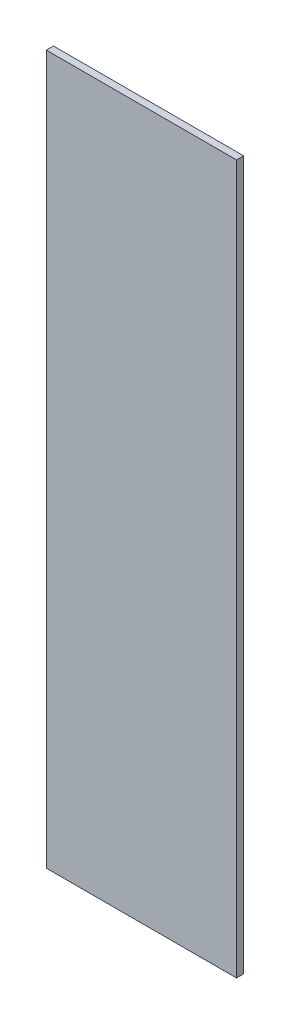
ISO-10303-21;
HEADER;
FILE_DESCRIPTION(('STEP AP214'),'2;1');
FILE_NAME('part.step','',(''),(''),'','','');
FILE_SCHEMA(('AUTOMOTIVE_DESIGN { 1 0 10303 214 1 1 1 1 }'));
ENDSEC;
DATA;
#1=APPLICATION_CONTEXT('core data for automotive mechanical design processes');
#2=APPLICATION_PROTOCOL_DEFINITION('international standard','automotive_design',2000,#1);
#3=PRODUCT_CONTEXT('',#1,'mechanical');
#4=PRODUCT('Part','Part','',(#3));
#5=PRODUCT_RELATED_PRODUCT_CATEGORY('part','',(#4));
#6=PRODUCT_DEFINITION_FORMATION('','',#4);
#7=PRODUCT_DEFINITION_CONTEXT('part definition',#1,'design');
#8=PRODUCT_DEFINITION('design','',#6,#7);
#9=PRODUCT_DEFINITION_SHAPE('','',#8);
#10=(LENGTH_UNIT() NAMED_UNIT(*) SI_UNIT(.MILLI.,.METRE.));
#11=(NAMED_UNIT(*) PLANE_ANGLE_UNIT() SI_UNIT($,.RADIAN.));
#12=(NAMED_UNIT(*) SI_UNIT($,.STERADIAN.) SOLID_ANGLE_UNIT());
#13=UNCERTAINTY_MEASURE_WITH_UNIT(LENGTH_MEASURE(1.E-05),#10,'distance_accuracy_value','');
#14=(GEOMETRIC_REPRESENTATION_CONTEXT(3) GLOBAL_UNCERTAINTY_ASSIGNED_CONTEXT((#13)) GLOBAL_UNIT_ASSIGNED_CONTEXT((#10,
#11,#12)) REPRESENTATION_CONTEXT('',''));
#15=CARTESIAN_POINT('',(0.,0.,0.));
#16=DIRECTION('',(0.,0.,1.));
#17=DIRECTION('',(1.,0.,0.));
#18=AXIS2_PLACEMENT_3D('',#15,#16,#17);
#19=CARTESIAN_POINT('',(200.,745.,15.));
#20=DIRECTION('',(-1.,0.,0.));
#21=DIRECTION('',(0.,-1.,0.));
#22=AXIS2_PLACEMENT_3D('',#19,#20,#21);
#23=PLANE('',#22);
#24=DIRECTION('',(0.,1.,0.));
#25=VECTOR('',#24,1.);
#26=CARTESIAN_POINT('',(200.,745.,0.));
#27=LINE('',#26,#25);
#28=CARTESIAN_POINT('',(200.,-745.,0.));
#29=VERTEX_POINT('',#28);
#30=CARTESIAN_POINT('',(200.,745.,0.));
#31=VERTEX_POINT('',#30);
#32=EDGE_CURVE('E113',#29,#31,#27,.T.);
#33=ORIENTED_EDGE('',*,*,#32,.T.);
#34=DIRECTION('',(0.,0.,-1.));
#35=VECTOR('',#34,1.);
#36=CARTESIAN_POINT('',(200.,745.,15.));
#37=LINE('',#36,#35);
#38=CARTESIAN_POINT('',(200.,745.,15.));
#39=VERTEX_POINT('',#38);
#40=EDGE_CURVE('E11',#39,#31,#37,.T.);
#41=ORIENTED_EDGE('',*,*,#40,.F.);
#42=DIRECTION('',(0.,1.,0.));
#43=VECTOR('',#42,1.);
#44=CARTESIAN_POINT('',(200.,745.,15.));
#45=LINE('',#44,#43);
#46=CARTESIAN_POINT('',(200.,-745.,15.));
#47=VERTEX_POINT('',#46);
#48=EDGE_CURVE('E97',#47,#39,#45,.T.);
#49=ORIENTED_EDGE('',*,*,#48,.F.);
#50=DIRECTION('',(0.,0.,-1.));
#51=VECTOR('',#50,1.);
#52=CARTESIAN_POINT('',(200.,-745.,15.));
#53=LINE('',#52,#51);
#54=EDGE_CURVE('E109',#47,#29,#53,.T.);
#55=ORIENTED_EDGE('',*,*,#54,.T.);
#56=EDGE_LOOP('',(#33,#41,#49,#55));
#57=FACE_BOUND('',#56,.T.);
#58=ADVANCED_FACE('F45',(#57),#23,.F.);
#59=CARTESIAN_POINT('',(-200.,745.,15.));
#60=DIRECTION('',(0.,-1.,0.));
#61=DIRECTION('',(0.,0.,-1.));
#62=AXIS2_PLACEMENT_3D('',#59,#60,#61);
#63=PLANE('',#62);
#64=DIRECTION('',(-1.,0.,0.));
#65=VECTOR('',#64,1.);
#66=CARTESIAN_POINT('',(-200.,745.,0.));
#67=LINE('',#66,#65);
#68=CARTESIAN_POINT('',(-200.,745.,0.));
#69=VERTEX_POINT('',#68);
#70=EDGE_CURVE('E102',#31,#69,#67,.T.);
#71=ORIENTED_EDGE('',*,*,#70,.T.);
#72=DIRECTION('',(0.,0.,-1.));
#73=VECTOR('',#72,1.);
#74=CARTESIAN_POINT('',(-200.,745.,15.));
#75=LINE('',#74,#73);
#76=CARTESIAN_POINT('',(-200.,745.,15.));
#77=VERTEX_POINT('',#76);
#78=EDGE_CURVE('E54',#77,#69,#75,.T.);
#79=ORIENTED_EDGE('',*,*,#78,.F.);
#80=DIRECTION('',(-1.,0.,0.));
#81=VECTOR('',#80,1.);
#82=CARTESIAN_POINT('',(-200.,745.,15.));
#83=LINE('',#82,#81);
#84=EDGE_CURVE('E92',#39,#77,#83,.T.);
#85=ORIENTED_EDGE('',*,*,#84,.F.);
#86=ORIENTED_EDGE('',*,*,#40,.T.);
#87=EDGE_LOOP('',(#71,#79,#85,#86));
#88=FACE_BOUND('',#87,.T.);
#89=ADVANCED_FACE('F101',(#88),#63,.F.);
#90=CARTESIAN_POINT('',(-200.,745.,15.));
#91=DIRECTION('',(1.,0.,0.));
#92=DIRECTION('',(0.,1.,0.));
#93=AXIS2_PLACEMENT_3D('',#90,#91,#92);
#94=PLANE('',#93);
#95=DIRECTION('',(0.,-1.,0.));
#96=VECTOR('',#95,1.);
#97=CARTESIAN_POINT('',(-200.,745.,0.));
#98=LINE('',#97,#96);
#99=CARTESIAN_POINT('',(-200.,-745.,0.));
#100=VERTEX_POINT('',#99);
#101=EDGE_CURVE('E79',#69,#100,#98,.T.);
#102=ORIENTED_EDGE('',*,*,#101,.T.);
#103=DIRECTION('',(0.,0.,-1.));
#104=VECTOR('',#103,1.);
#105=CARTESIAN_POINT('',(-200.,-745.,15.));
#106=LINE('',#105,#104);
#107=CARTESIAN_POINT('',(-200.,-745.,15.));
#108=VERTEX_POINT('',#107);
#109=EDGE_CURVE('E104',#108,#100,#106,.T.);
#110=ORIENTED_EDGE('',*,*,#109,.F.);
#111=DIRECTION('',(0.,-1.,0.));
#112=VECTOR('',#111,1.);
#113=CARTESIAN_POINT('',(-200.,745.,15.));
#114=LINE('',#113,#112);
#115=EDGE_CURVE('E95',#77,#108,#114,.T.);
#116=ORIENTED_EDGE('',*,*,#115,.F.);
#117=ORIENTED_EDGE('',*,*,#78,.T.);
#118=EDGE_LOOP('',(#102,#110,#116,#117));
#119=FACE_BOUND('',#118,.T.);
#120=ADVANCED_FACE('F105',(#119),#94,.F.);
#121=CARTESIAN_POINT('',(-200.,-745.,15.));
#122=DIRECTION('',(0.,1.,0.));
#123=DIRECTION('',(0.,0.,1.));
#124=AXIS2_PLACEMENT_3D('',#121,#122,#123);
#125=PLANE('',#124);
#126=DIRECTION('',(1.,0.,0.));
#127=VECTOR('',#126,1.);
#128=CARTESIAN_POINT('',(-200.,-745.,0.));
#129=LINE('',#128,#127);
#130=EDGE_CURVE('E85',#100,#29,#129,.T.);
#131=ORIENTED_EDGE('',*,*,#130,.T.);
#132=ORIENTED_EDGE('',*,*,#54,.F.);
#133=DIRECTION('',(1.,0.,0.));
#134=VECTOR('',#133,1.);
#135=CARTESIAN_POINT('',(-200.,-745.,15.));
#136=LINE('',#135,#134);
#137=EDGE_CURVE('E62',#108,#47,#136,.T.);
#138=ORIENTED_EDGE('',*,*,#137,.F.);
#139=ORIENTED_EDGE('',*,*,#109,.T.);
#140=EDGE_LOOP('',(#131,#132,#138,#139));
#141=FACE_BOUND('',#140,.T.);
#142=ADVANCED_FACE('F126',(#141),#125,.F.);
#143=CARTESIAN_POINT('',(0.,0.,15.));
#144=DIRECTION('',(0.,0.,1.));
#145=DIRECTION('',(1.,0.,0.));
#146=AXIS2_PLACEMENT_3D('',#143,#144,#145);
#147=PLANE('',#146);
#148=ORIENTED_EDGE('',*,*,#48,.T.);
#149=ORIENTED_EDGE('',*,*,#84,.T.);
#150=ORIENTED_EDGE('',*,*,#115,.T.);
#151=ORIENTED_EDGE('',*,*,#137,.T.);
#152=EDGE_LOOP('',(#148,#149,#150,#151));
#153=FACE_BOUND('',#152,.T.);
#154=ADVANCED_FACE('F93',(#153),#147,.T.);
#155=CARTESIAN_POINT('',(0.,0.,0.));
#156=DIRECTION('',(0.,0.,1.));
#157=DIRECTION('',(1.,0.,0.));
#158=AXIS2_PLACEMENT_3D('',#155,#156,#157);
#159=PLANE('',#158);
#160=ORIENTED_EDGE('',*,*,#32,.F.);
#161=ORIENTED_EDGE('',*,*,#130,.F.);
#162=ORIENTED_EDGE('',*,*,#101,.F.);
#163=ORIENTED_EDGE('',*,*,#70,.F.);
#164=EDGE_LOOP('',(#160,#161,#162,#163));
#165=FACE_BOUND('',#164,.T.);
#166=ADVANCED_FACE('F129',(#165),#159,.F.);
#167=CLOSED_SHELL('',(#58,#89,#120,#142,#154,#166));
#168=MANIFOLD_SOLID_BREP('B2',#167);
#169=ADVANCED_BREP_SHAPE_REPRESENTATION('',(#18,#168),#14);
#170=SHAPE_DEFINITION_REPRESENTATION(#9,#169);
ENDSEC;
END-ISO-10303-21;
